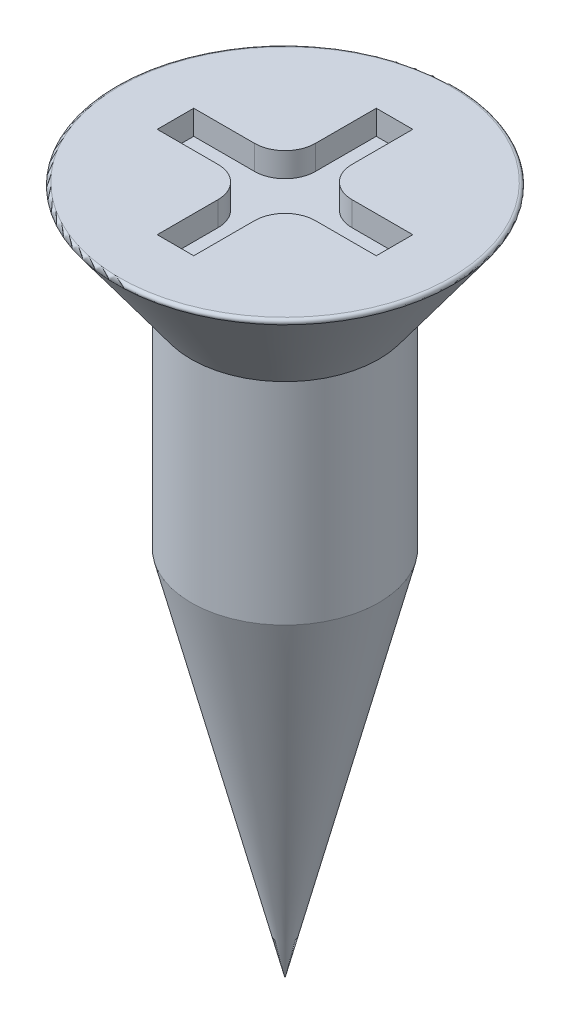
from build123d import *

# Parameters (mm, degrees)
SKETCH2_R           = 0.68257297
BOSS_EXTRUDE1_DEPTH = 1
CUT_EXTRUDE1_DEPTH  = 0.4
FILLET1_R           = 0.05
FILLET2_R           = 0.5


with BuildPart() as part:
    # Sketch1 → Revolve1 (revolve)
    with BuildSketch(Plane.XY):
        Polygon((-1.543044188, 9.578139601), (-2.8217128, 11.329596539), (-0.682551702, 11.329596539), (0, 10.383825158), (0, 0), (-1.543044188, 6.113606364), align=None)
    revolve(axis=Axis((0, 10.383825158, 0), (0, -1, 0)))

    # Sketch2 → Boss-Extrude1 (add)
    with BuildSketch(Plane(origin=(0, 11.329596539, 0), x_dir=(1, 0, 0), z_dir=(0, 1, 0))):
        Circle(SKETCH2_R)
    extrude(amount=-BOSS_EXTRUDE1_DEPTH)

    # Sketch3 → Cut-Extrude1 (cut)
    with BuildSketch(Plane(origin=(0, 11.329596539, 0), x_dir=(1, 0, 0), z_dir=(0, 1, 0))):
        Polygon((-0.3, 1.8), (-0.3, 0.3), (-1.8, 0.3), (-1.8, -0.3), (-0.3, -0.3), (-0.3, -1.8), (0.3, -1.8), (0.3, -0.3), (1.8, -0.3), (1.8, 0.3), (0.3, 0.3), (0.3, 1.8), align=None)
    extrude(amount=-CUT_EXTRUDE1_DEPTH, mode=Mode.SUBTRACT)

    # Fillet1
    fillet1_edges = [part.edges().sort_by_distance(p)[0] for p in [
        (2.8217128, 11.329596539, 0),
    ]]
    fillet(fillet1_edges, radius=FILLET1_R)

    # Fillet2
    fillet2_edges = [part.edges().sort_by_distance(p)[0] for p in [
        (0.3, 11.129596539, -0.3),
        (0.3, 11.129596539, 0.3),
        (-0.3, 11.129596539, 0.3),
        (-0.3, 11.129596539, -0.3),
    ]]
    fillet(fillet2_edges, radius=FILLET2_R)


solid = part.part
